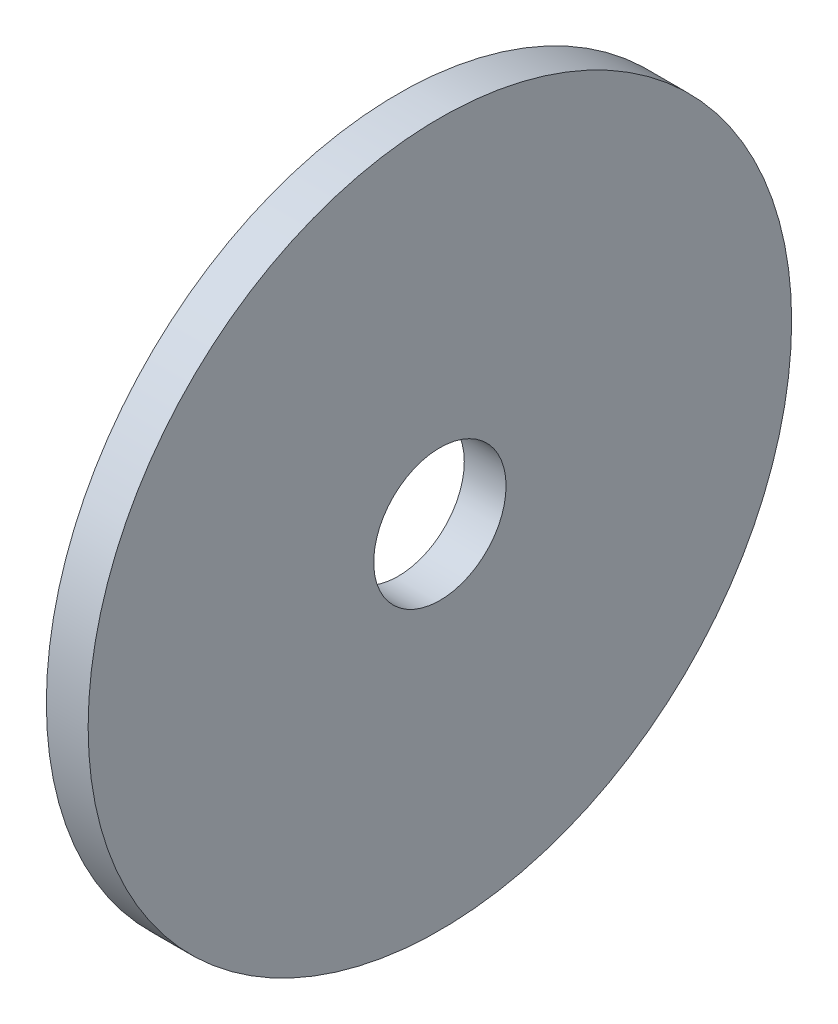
ISO-10303-21;
HEADER;
FILE_DESCRIPTION(('STEP AP214'),'2;1');
FILE_NAME('part.step','',(''),(''),'','','');
FILE_SCHEMA(('AUTOMOTIVE_DESIGN { 1 0 10303 214 1 1 1 1 }'));
ENDSEC;
DATA;
#1=APPLICATION_CONTEXT('core data for automotive mechanical design processes');
#2=APPLICATION_PROTOCOL_DEFINITION('international standard','automotive_design',2000,#1);
#3=PRODUCT_CONTEXT('',#1,'mechanical');
#4=PRODUCT('Part','Part','',(#3));
#5=PRODUCT_RELATED_PRODUCT_CATEGORY('part','',(#4));
#6=PRODUCT_DEFINITION_FORMATION('','',#4);
#7=PRODUCT_DEFINITION_CONTEXT('part definition',#1,'design');
#8=PRODUCT_DEFINITION('design','',#6,#7);
#9=PRODUCT_DEFINITION_SHAPE('','',#8);
#10=(LENGTH_UNIT() NAMED_UNIT(*) SI_UNIT(.MILLI.,.METRE.));
#11=(NAMED_UNIT(*) PLANE_ANGLE_UNIT() SI_UNIT($,.RADIAN.));
#12=(NAMED_UNIT(*) SI_UNIT($,.STERADIAN.) SOLID_ANGLE_UNIT());
#13=UNCERTAINTY_MEASURE_WITH_UNIT(LENGTH_MEASURE(1.E-05),#10,'distance_accuracy_value','');
#14=(GEOMETRIC_REPRESENTATION_CONTEXT(3) GLOBAL_UNCERTAINTY_ASSIGNED_CONTEXT((#13)) GLOBAL_UNIT_ASSIGNED_CONTEXT((#10,
#11,#12)) REPRESENTATION_CONTEXT('',''));
#15=CARTESIAN_POINT('',(0.,0.,0.));
#16=DIRECTION('',(0.,0.,1.));
#17=DIRECTION('',(1.,0.,0.));
#18=AXIS2_PLACEMENT_3D('',#15,#16,#17);
#19=CARTESIAN_POINT('',(-3.,0.,0.));
#20=DIRECTION('',(1.,0.,0.));
#21=DIRECTION('',(0.,0.,-1.));
#22=AXIS2_PLACEMENT_3D('',#19,#20,#21);
#23=CYLINDRICAL_SURFACE('',#22,25.25);
#24=CARTESIAN_POINT('',(-3.,0.,0.));
#25=DIRECTION('',(1.,0.,0.));
#26=DIRECTION('',(0.,0.,-1.));
#27=AXIS2_PLACEMENT_3D('',#24,#25,#26);
#28=CIRCLE('',#27,25.25);
#29=CARTESIAN_POINT('',(-3.,0.,-25.25));
#30=VERTEX_POINT('',#29);
#31=EDGE_CURVE('E10',#30,#30,#28,.T.);
#32=ORIENTED_EDGE('',*,*,#31,.T.);
#33=EDGE_LOOP('',(#32));
#34=FACE_BOUND('',#33,.T.);
#35=CARTESIAN_POINT('',(0.,0.,0.));
#36=DIRECTION('',(1.,0.,0.));
#37=DIRECTION('',(0.,0.,-1.));
#38=AXIS2_PLACEMENT_3D('',#35,#36,#37);
#39=CIRCLE('',#38,25.25);
#40=CARTESIAN_POINT('',(0.,0.,-25.25));
#41=VERTEX_POINT('',#40);
#42=EDGE_CURVE('E38',#41,#41,#39,.T.);
#43=ORIENTED_EDGE('',*,*,#42,.F.);
#44=EDGE_LOOP('',(#43));
#45=FACE_BOUND('',#44,.T.);
#46=ADVANCED_FACE('F35',(#34,#45),#23,.T.);
#47=CARTESIAN_POINT('',(-3.,0.,0.));
#48=DIRECTION('',(1.,0.,0.));
#49=DIRECTION('',(0.,0.,-1.));
#50=AXIS2_PLACEMENT_3D('',#47,#48,#49);
#51=PLANE('',#50);
#52=CARTESIAN_POINT('',(-3.,0.,0.));
#53=DIRECTION('',(1.,0.,0.));
#54=DIRECTION('',(0.,0.,-1.));
#55=AXIS2_PLACEMENT_3D('',#52,#53,#54);
#56=CIRCLE('',#55,4.75);
#57=CARTESIAN_POINT('',(-3.,0.,-4.75));
#58=VERTEX_POINT('',#57);
#59=EDGE_CURVE('E45',#58,#58,#56,.T.);
#60=ORIENTED_EDGE('',*,*,#59,.T.);
#61=EDGE_LOOP('',(#60));
#62=FACE_BOUND('',#61,.T.);
#63=ORIENTED_EDGE('',*,*,#31,.F.);
#64=EDGE_LOOP('',(#63));
#65=FACE_BOUND('',#64,.T.);
#66=ADVANCED_FACE('F53',(#62,#65),#51,.F.);
#67=CARTESIAN_POINT('',(0.,0.,0.));
#68=DIRECTION('',(1.,0.,0.));
#69=DIRECTION('',(0.,0.,-1.));
#70=AXIS2_PLACEMENT_3D('',#67,#68,#69);
#71=PLANE('',#70);
#72=CARTESIAN_POINT('',(0.,0.,0.));
#73=DIRECTION('',(1.,0.,0.));
#74=DIRECTION('',(0.,0.,-1.));
#75=AXIS2_PLACEMENT_3D('',#72,#73,#74);
#76=CIRCLE('',#75,4.75);
#77=CARTESIAN_POINT('',(0.,0.,-4.75));
#78=VERTEX_POINT('',#77);
#79=EDGE_CURVE('E47',#78,#78,#76,.T.);
#80=ORIENTED_EDGE('',*,*,#79,.F.);
#81=EDGE_LOOP('',(#80));
#82=FACE_BOUND('',#81,.T.);
#83=ORIENTED_EDGE('',*,*,#42,.T.);
#84=EDGE_LOOP('',(#83));
#85=FACE_BOUND('',#84,.T.);
#86=ADVANCED_FACE('F59',(#82,#85),#71,.T.);
#87=CARTESIAN_POINT('',(-3.,0.,0.));
#88=DIRECTION('',(1.,0.,0.));
#89=DIRECTION('',(0.,0.,-1.));
#90=AXIS2_PLACEMENT_3D('',#87,#88,#89);
#91=CYLINDRICAL_SURFACE('',#90,4.75);
#92=ORIENTED_EDGE('',*,*,#59,.F.);
#93=EDGE_LOOP('',(#92));
#94=FACE_BOUND('',#93,.T.);
#95=ORIENTED_EDGE('',*,*,#79,.T.);
#96=EDGE_LOOP('',(#95));
#97=FACE_BOUND('',#96,.T.);
#98=ADVANCED_FACE('F56',(#94,#97),#91,.F.);
#99=CLOSED_SHELL('',(#46,#66,#86,#98));
#100=MANIFOLD_SOLID_BREP('B2',#99);
#101=ADVANCED_BREP_SHAPE_REPRESENTATION('',(#18,#100),#14);
#102=SHAPE_DEFINITION_REPRESENTATION(#9,#101);
ENDSEC;
END-ISO-10303-21;
